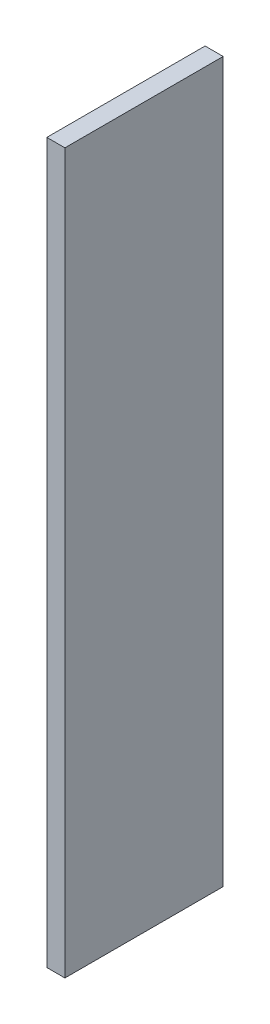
ISO-10303-21;
HEADER;
FILE_DESCRIPTION(('STEP AP214'),'2;1');
FILE_NAME('part.step','',(''),(''),'','','');
FILE_SCHEMA(('AUTOMOTIVE_DESIGN { 1 0 10303 214 1 1 1 1 }'));
ENDSEC;
DATA;
#1=APPLICATION_CONTEXT('core data for automotive mechanical design processes');
#2=APPLICATION_PROTOCOL_DEFINITION('international standard','automotive_design',2000,#1);
#3=PRODUCT_CONTEXT('',#1,'mechanical');
#4=PRODUCT('Part','Part','',(#3));
#5=PRODUCT_RELATED_PRODUCT_CATEGORY('part','',(#4));
#6=PRODUCT_DEFINITION_FORMATION('','',#4);
#7=PRODUCT_DEFINITION_CONTEXT('part definition',#1,'design');
#8=PRODUCT_DEFINITION('design','',#6,#7);
#9=PRODUCT_DEFINITION_SHAPE('','',#8);
#10=(LENGTH_UNIT() NAMED_UNIT(*) SI_UNIT(.MILLI.,.METRE.));
#11=(NAMED_UNIT(*) PLANE_ANGLE_UNIT() SI_UNIT($,.RADIAN.));
#12=(NAMED_UNIT(*) SI_UNIT($,.STERADIAN.) SOLID_ANGLE_UNIT());
#13=UNCERTAINTY_MEASURE_WITH_UNIT(LENGTH_MEASURE(1.E-05),#10,'distance_accuracy_value','');
#14=(GEOMETRIC_REPRESENTATION_CONTEXT(3) GLOBAL_UNCERTAINTY_ASSIGNED_CONTEXT((#13)) GLOBAL_UNIT_ASSIGNED_CONTEXT((#10,
#11,#12)) REPRESENTATION_CONTEXT('',''));
#15=CARTESIAN_POINT('',(0.,0.,0.));
#16=DIRECTION('',(0.,0.,1.));
#17=DIRECTION('',(1.,0.,0.));
#18=AXIS2_PLACEMENT_3D('',#15,#16,#17);
#19=CARTESIAN_POINT('',(3.90000000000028,-79.5,0.));
#20=DIRECTION('',(0.,1.,0.));
#21=DIRECTION('',(-1.,0.,0.));
#22=AXIS2_PLACEMENT_3D('',#19,#20,#21);
#23=PLANE('',#22);
#24=DIRECTION('',(0.,0.,-1.));
#25=VECTOR('',#24,1.);
#26=CARTESIAN_POINT('',(2.77338915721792E-13,-79.5,0.));
#27=LINE('',#26,#25);
#28=CARTESIAN_POINT('',(4.03756889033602E-13,-79.5,35.));
#29=VERTEX_POINT('',#28);
#30=CARTESIAN_POINT('',(2.77555756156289E-13,-79.5,0.));
#31=VERTEX_POINT('',#30);
#32=EDGE_CURVE('E83',#29,#31,#27,.T.);
#33=ORIENTED_EDGE('',*,*,#32,.T.);
#34=DIRECTION('',(1.,0.,0.));
#35=VECTOR('',#34,1.);
#36=CARTESIAN_POINT('',(3.90000000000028,-79.5,0.));
#37=LINE('',#36,#35);
#38=CARTESIAN_POINT('',(4.00000000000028,-79.5,0.));
#39=VERTEX_POINT('',#38);
#40=EDGE_CURVE('E10',#31,#39,#37,.T.);
#41=ORIENTED_EDGE('',*,*,#40,.T.);
#42=DIRECTION('',(0.,0.,-1.));
#43=VECTOR('',#42,1.);
#44=CARTESIAN_POINT('',(4.00000000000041,-79.5,35.));
#45=LINE('',#44,#43);
#46=CARTESIAN_POINT('',(4.00000000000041,-79.5,35.));
#47=VERTEX_POINT('',#46);
#48=EDGE_CURVE('E85',#47,#39,#45,.T.);
#49=ORIENTED_EDGE('',*,*,#48,.F.);
#50=DIRECTION('',(-1.,0.,0.));
#51=VECTOR('',#50,1.);
#52=CARTESIAN_POINT('',(3.9000000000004,-79.5,35.));
#53=LINE('',#52,#51);
#54=EDGE_CURVE('E24',#47,#29,#53,.T.);
#55=ORIENTED_EDGE('',*,*,#54,.T.);
#56=EDGE_LOOP('',(#33,#41,#49,#55));
#57=FACE_BOUND('',#56,.T.);
#58=ADVANCED_FACE('F16',(#57),#23,.F.);
#59=CARTESIAN_POINT('',(3.89999999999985,79.5,35.));
#60=DIRECTION('',(0.,0.,-1.));
#61=DIRECTION('',(-1.,0.,0.));
#62=AXIS2_PLACEMENT_3D('',#59,#60,#61);
#63=PLANE('',#62);
#64=ORIENTED_EDGE('',*,*,#54,.F.);
#65=DIRECTION('',(0.,-1.,0.));
#66=VECTOR('',#65,1.);
#67=CARTESIAN_POINT('',(3.99999999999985,79.5,35.));
#68=LINE('',#67,#66);
#69=CARTESIAN_POINT('',(3.99999999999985,79.5,35.));
#70=VERTEX_POINT('',#69);
#71=EDGE_CURVE('E80',#70,#47,#68,.T.);
#72=ORIENTED_EDGE('',*,*,#71,.F.);
#73=DIRECTION('',(-1.,0.,0.));
#74=VECTOR('',#73,1.);
#75=CARTESIAN_POINT('',(3.89999999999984,79.5,35.));
#76=LINE('',#75,#74);
#77=CARTESIAN_POINT('',(-1.51354623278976E-13,79.5,35.));
#78=VERTEX_POINT('',#77);
#79=EDGE_CURVE('E38',#70,#78,#76,.T.);
#80=ORIENTED_EDGE('',*,*,#79,.T.);
#81=DIRECTION('',(0.,-1.,0.));
#82=VECTOR('',#81,1.);
#83=CARTESIAN_POINT('',(-1.50704101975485E-13,79.5,35.));
#84=LINE('',#83,#82);
#85=EDGE_CURVE('E82',#29,#78,#84,.F.);
#86=ORIENTED_EDGE('',*,*,#85,.F.);
#87=EDGE_LOOP('',(#64,#72,#80,#86));
#88=FACE_BOUND('',#87,.T.);
#89=ADVANCED_FACE('F78',(#88),#63,.F.);
#90=CARTESIAN_POINT('',(-1.50920942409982E-13,79.5,35.));
#91=DIRECTION('',(1.,0.,0.));
#92=DIRECTION('',(0.,0.,-1.));
#93=AXIS2_PLACEMENT_3D('',#90,#91,#92);
#94=PLANE('',#93);
#95=ORIENTED_EDGE('',*,*,#32,.F.);
#96=ORIENTED_EDGE('',*,*,#85,.T.);
#97=DIRECTION('',(0.,0.,-1.));
#98=VECTOR('',#97,1.);
#99=CARTESIAN_POINT('',(-2.77772596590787E-13,79.5,0.));
#100=LINE('',#99,#98);
#101=CARTESIAN_POINT('',(-2.77555756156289E-13,79.5,0.));
#102=VERTEX_POINT('',#101);
#103=EDGE_CURVE('E133',#78,#102,#100,.T.);
#104=ORIENTED_EDGE('',*,*,#103,.T.);
#105=DIRECTION('',(0.,1.,0.));
#106=VECTOR('',#105,1.);
#107=CARTESIAN_POINT('',(2.78639958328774E-13,-79.7828427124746,0.));
#108=LINE('',#107,#106);
#109=CARTESIAN_POINT('',(-1.67617655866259E-13,48.,0.));
#110=VERTEX_POINT('',#109);
#111=EDGE_CURVE('E99',#110,#102,#108,.T.);
#112=ORIENTED_EDGE('',*,*,#111,.F.);
#113=DIRECTION('',(0.,0.,-1.));
#114=VECTOR('',#113,1.);
#115=CARTESIAN_POINT('',(0.,48.,35.));
#116=LINE('',#115,#114);
#117=CARTESIAN_POINT('',(-1.45933612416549E-13,48.,6.));
#118=VERTEX_POINT('',#117);
#119=EDGE_CURVE('E104',#118,#110,#116,.T.);
#120=ORIENTED_EDGE('',*,*,#119,.F.);
#121=DIRECTION('',(0.,1.,0.));
#122=VECTOR('',#121,1.);
#123=CARTESIAN_POINT('',(-2.55654872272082E-13,79.5,6.));
#124=LINE('',#123,#122);
#125=CARTESIAN_POINT('',(1.89518539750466E-13,-48.,6.));
#126=VERTEX_POINT('',#125);
#127=EDGE_CURVE('E106',#126,#118,#124,.T.);
#128=ORIENTED_EDGE('',*,*,#127,.F.);
#129=DIRECTION('',(0.,0.,-1.));
#130=VECTOR('',#129,1.);
#131=CARTESIAN_POINT('',(2.94252469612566E-13,-48.,35.));
#132=LINE('',#131,#130);
#133=CARTESIAN_POINT('',(1.67617655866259E-13,-48.,0.));
#134=VERTEX_POINT('',#133);
#135=EDGE_CURVE('E109',#134,#126,#132,.F.);
#136=ORIENTED_EDGE('',*,*,#135,.F.);
#137=EDGE_CURVE('E100',#31,#134,#108,.T.);
#138=ORIENTED_EDGE('',*,*,#137,.F.);
#139=EDGE_LOOP('',(#95,#96,#104,#112,#120,#128,#136,#138));
#140=FACE_BOUND('',#139,.T.);
#141=ADVANCED_FACE('F18',(#140),#94,.F.);
#142=CARTESIAN_POINT('',(3.89999999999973,79.5,0.));
#143=DIRECTION('',(0.,1.,0.));
#144=DIRECTION('',(-1.,0.,0.));
#145=AXIS2_PLACEMENT_3D('',#142,#143,#144);
#146=PLANE('',#145);
#147=DIRECTION('',(1.,0.,0.));
#148=VECTOR('',#147,1.);
#149=CARTESIAN_POINT('',(3.89999999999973,79.5,0.));
#150=LINE('',#149,#148);
#151=CARTESIAN_POINT('',(3.99999999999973,79.5,0.));
#152=VERTEX_POINT('',#151);
#153=EDGE_CURVE('E136',#102,#152,#150,.T.);
#154=ORIENTED_EDGE('',*,*,#153,.F.);
#155=ORIENTED_EDGE('',*,*,#103,.F.);
#156=ORIENTED_EDGE('',*,*,#79,.F.);
#157=DIRECTION('',(0.,0.,1.));
#158=VECTOR('',#157,1.);
#159=CARTESIAN_POINT('',(3.99999999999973,79.5,0.));
#160=LINE('',#159,#158);
#161=EDGE_CURVE('E94',#152,#70,#160,.T.);
#162=ORIENTED_EDGE('',*,*,#161,.F.);
#163=EDGE_LOOP('',(#154,#155,#156,#162));
#164=FACE_BOUND('',#163,.T.);
#165=ADVANCED_FACE('F161',(#164),#146,.T.);
#166=CARTESIAN_POINT('',(-6.,0.,17.5));
#167=DIRECTION('',(-1.,0.,0.));
#168=DIRECTION('',(0.,0.,1.));
#169=AXIS2_PLACEMENT_3D('',#166,#167,#168);
#170=PLANE('',#169);
#171=DIRECTION('',(0.,0.,1.));
#172=VECTOR('',#171,1.);
#173=CARTESIAN_POINT('',(-5.99999999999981,-48.,6.));
#174=LINE('',#173,#172);
#175=CARTESIAN_POINT('',(-5.99999999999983,-48.,0.));
#176=VERTEX_POINT('',#175);
#177=CARTESIAN_POINT('',(-5.99999999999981,-48.,6.));
#178=VERTEX_POINT('',#177);
#179=EDGE_CURVE('E126',#176,#178,#174,.T.);
#180=ORIENTED_EDGE('',*,*,#179,.T.);
#181=DIRECTION('',(0.,1.,0.));
#182=VECTOR('',#181,1.);
#183=CARTESIAN_POINT('',(-6.00000000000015,48.,6.));
#184=LINE('',#183,#182);
#185=CARTESIAN_POINT('',(-6.00000000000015,48.,6.));
#186=VERTEX_POINT('',#185);
#187=EDGE_CURVE('E121',#178,#186,#184,.T.);
#188=ORIENTED_EDGE('',*,*,#187,.T.);
#189=DIRECTION('',(0.,0.,-1.));
#190=VECTOR('',#189,1.);
#191=CARTESIAN_POINT('',(-6.00000000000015,48.,6.));
#192=LINE('',#191,#190);
#193=CARTESIAN_POINT('',(-6.00000000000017,48.,0.));
#194=VERTEX_POINT('',#193);
#195=EDGE_CURVE('E115',#186,#194,#192,.T.);
#196=ORIENTED_EDGE('',*,*,#195,.T.);
#197=DIRECTION('',(0.,1.,0.));
#198=VECTOR('',#197,1.);
#199=CARTESIAN_POINT('',(-6.00000000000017,48.,0.));
#200=LINE('',#199,#198);
#201=EDGE_CURVE('E103',#194,#176,#200,.F.);
#202=ORIENTED_EDGE('',*,*,#201,.T.);
#203=EDGE_LOOP('',(#180,#188,#196,#202));
#204=FACE_BOUND('',#203,.T.);
#205=ADVANCED_FACE('F149',(#204),#170,.T.);
#206=CARTESIAN_POINT('',(-6.00000000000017,48.,0.));
#207=DIRECTION('',(0.,0.,1.));
#208=DIRECTION('',(1.,0.,0.));
#209=AXIS2_PLACEMENT_3D('',#206,#207,#208);
#210=PLANE('',#209);
#211=DIRECTION('',(-1.,0.,0.));
#212=VECTOR('',#211,1.);
#213=CARTESIAN_POINT('',(-5.99999999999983,-48.,0.));
#214=LINE('',#213,#212);
#215=EDGE_CURVE('E128',#134,#176,#214,.T.);
#216=ORIENTED_EDGE('',*,*,#215,.T.);
#217=ORIENTED_EDGE('',*,*,#201,.F.);
#218=DIRECTION('',(1.,0.,0.));
#219=VECTOR('',#218,1.);
#220=CARTESIAN_POINT('',(-6.00000000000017,48.,0.));
#221=LINE('',#220,#219);
#222=EDGE_CURVE('E112',#194,#110,#221,.T.);
#223=ORIENTED_EDGE('',*,*,#222,.T.);
#224=ORIENTED_EDGE('',*,*,#111,.T.);
#225=ORIENTED_EDGE('',*,*,#153,.T.);
#226=DIRECTION('',(0.,1.,0.));
#227=VECTOR('',#226,1.);
#228=CARTESIAN_POINT('',(4.00000000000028,-79.5,0.));
#229=LINE('',#228,#227);
#230=EDGE_CURVE('E89',#39,#152,#229,.T.);
#231=ORIENTED_EDGE('',*,*,#230,.F.);
#232=ORIENTED_EDGE('',*,*,#40,.F.);
#233=ORIENTED_EDGE('',*,*,#137,.T.);
#234=EDGE_LOOP('',(#216,#217,#223,#224,#225,#231,#232,#233));
#235=FACE_BOUND('',#234,.T.);
#236=ADVANCED_FACE('F143',(#235),#210,.F.);
#237=CARTESIAN_POINT('',(-5.99999999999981,-48.,6.));
#238=DIRECTION('',(0.,1.,0.));
#239=DIRECTION('',(-1.,0.,0.));
#240=AXIS2_PLACEMENT_3D('',#237,#238,#239);
#241=PLANE('',#240);
#242=ORIENTED_EDGE('',*,*,#135,.T.);
#243=DIRECTION('',(-1.,0.,0.));
#244=VECTOR('',#243,1.);
#245=CARTESIAN_POINT('',(-5.99999999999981,-48.,6.));
#246=LINE('',#245,#244);
#247=EDGE_CURVE('E123',#126,#178,#246,.T.);
#248=ORIENTED_EDGE('',*,*,#247,.T.);
#249=ORIENTED_EDGE('',*,*,#179,.F.);
#250=ORIENTED_EDGE('',*,*,#215,.F.);
#251=EDGE_LOOP('',(#242,#248,#249,#250));
#252=FACE_BOUND('',#251,.T.);
#253=ADVANCED_FACE('F146',(#252),#241,.F.);
#254=CARTESIAN_POINT('',(-6.00000000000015,48.,6.));
#255=DIRECTION('',(0.,0.,-1.));
#256=DIRECTION('',(-1.,0.,0.));
#257=AXIS2_PLACEMENT_3D('',#254,#255,#256);
#258=PLANE('',#257);
#259=DIRECTION('',(1.,0.,0.));
#260=VECTOR('',#259,1.);
#261=CARTESIAN_POINT('',(-6.00000000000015,48.,6.));
#262=LINE('',#261,#260);
#263=EDGE_CURVE('E118',#118,#186,#262,.F.);
#264=ORIENTED_EDGE('',*,*,#263,.T.);
#265=ORIENTED_EDGE('',*,*,#187,.F.);
#266=ORIENTED_EDGE('',*,*,#247,.F.);
#267=ORIENTED_EDGE('',*,*,#127,.T.);
#268=EDGE_LOOP('',(#264,#265,#266,#267));
#269=FACE_BOUND('',#268,.T.);
#270=ADVANCED_FACE('F152',(#269),#258,.F.);
#271=CARTESIAN_POINT('',(-6.00000000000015,48.,6.));
#272=DIRECTION('',(0.,-1.,0.));
#273=DIRECTION('',(0.,0.,-1.));
#274=AXIS2_PLACEMENT_3D('',#271,#272,#273);
#275=PLANE('',#274);
#276=ORIENTED_EDGE('',*,*,#119,.T.);
#277=ORIENTED_EDGE('',*,*,#222,.F.);
#278=ORIENTED_EDGE('',*,*,#195,.F.);
#279=ORIENTED_EDGE('',*,*,#263,.F.);
#280=EDGE_LOOP('',(#276,#277,#278,#279));
#281=FACE_BOUND('',#280,.T.);
#282=ADVANCED_FACE('F155',(#281),#275,.F.);
#283=CARTESIAN_POINT('',(4.,0.,0.));
#284=DIRECTION('',(1.,0.,0.));
#285=DIRECTION('',(0.,0.,-1.));
#286=AXIS2_PLACEMENT_3D('',#283,#284,#285);
#287=PLANE('',#286);
#288=ORIENTED_EDGE('',*,*,#71,.T.);
#289=ORIENTED_EDGE('',*,*,#48,.T.);
#290=ORIENTED_EDGE('',*,*,#230,.T.);
#291=ORIENTED_EDGE('',*,*,#161,.T.);
#292=EDGE_LOOP('',(#288,#289,#290,#291));
#293=FACE_BOUND('',#292,.T.);
#294=ADVANCED_FACE('F92',(#293),#287,.T.);
#295=CLOSED_SHELL('',(#58,#89,#141,#165,#205,#236,#253,#270,#282,#294));
#296=MANIFOLD_SOLID_BREP('B1',#295);
#297=ADVANCED_BREP_SHAPE_REPRESENTATION('',(#18,#296),#14);
#298=SHAPE_DEFINITION_REPRESENTATION(#9,#297);
ENDSEC;
END-ISO-10303-21;
